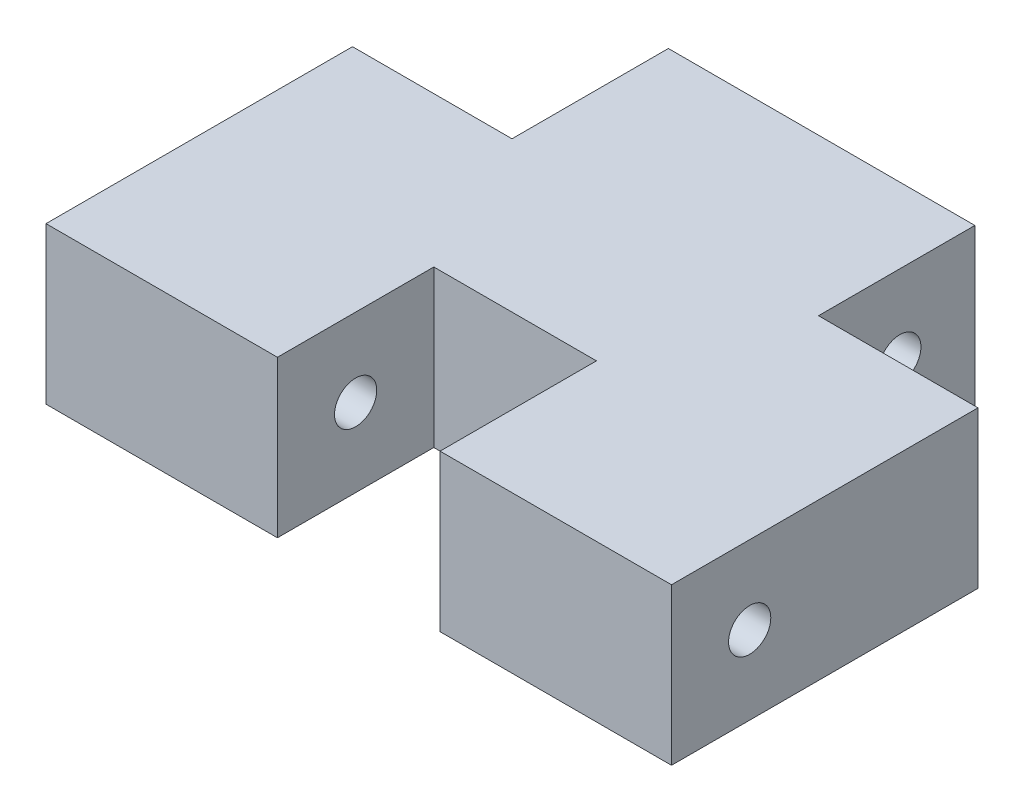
ISO-10303-21;
HEADER;
FILE_DESCRIPTION(('STEP AP214'),'2;1');
FILE_NAME('part.step','',(''),(''),'','','');
FILE_SCHEMA(('AUTOMOTIVE_DESIGN { 1 0 10303 214 1 1 1 1 }'));
ENDSEC;
DATA;
#1=APPLICATION_CONTEXT('core data for automotive mechanical design processes');
#2=APPLICATION_PROTOCOL_DEFINITION('international standard','automotive_design',2000,#1);
#3=PRODUCT_CONTEXT('',#1,'mechanical');
#4=PRODUCT('Part','Part','',(#3));
#5=PRODUCT_RELATED_PRODUCT_CATEGORY('part','',(#4));
#6=PRODUCT_DEFINITION_FORMATION('','',#4);
#7=PRODUCT_DEFINITION_CONTEXT('part definition',#1,'design');
#8=PRODUCT_DEFINITION('design','',#6,#7);
#9=PRODUCT_DEFINITION_SHAPE('','',#8);
#10=(LENGTH_UNIT() NAMED_UNIT(*) SI_UNIT(.MILLI.,.METRE.));
#11=(NAMED_UNIT(*) PLANE_ANGLE_UNIT() SI_UNIT($,.RADIAN.));
#12=(NAMED_UNIT(*) SI_UNIT($,.STERADIAN.) SOLID_ANGLE_UNIT());
#13=UNCERTAINTY_MEASURE_WITH_UNIT(LENGTH_MEASURE(1.E-05),#10,'distance_accuracy_value','');
#14=(GEOMETRIC_REPRESENTATION_CONTEXT(3) GLOBAL_UNCERTAINTY_ASSIGNED_CONTEXT((#13)) GLOBAL_UNIT_ASSIGNED_CONTEXT((#10,
#11,#12)) REPRESENTATION_CONTEXT('',''));
#15=CARTESIAN_POINT('',(0.,0.,0.));
#16=DIRECTION('',(0.,0.,1.));
#17=DIRECTION('',(1.,0.,0.));
#18=AXIS2_PLACEMENT_3D('',#15,#16,#17);
#19=CARTESIAN_POINT('',(-6.223,6.35,0.127));
#20=DIRECTION('',(1.,0.,0.));
#21=DIRECTION('',(0.,0.,-1.));
#22=AXIS2_PLACEMENT_3D('',#19,#20,#21);
#23=PLANE('',#22);
#24=CARTESIAN_POINT('',(-6.223,3.175,-3.175));
#25=DIRECTION('',(1.,0.,0.));
#26=DIRECTION('',(0.,0.,-1.));
#27=AXIS2_PLACEMENT_3D('',#24,#25,#26);
#28=CIRCLE('',#27,0.857250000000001);
#29=CARTESIAN_POINT('',(-6.223,3.175,-4.03225));
#30=VERTEX_POINT('',#29);
#31=EDGE_CURVE('E204',#30,#30,#28,.T.);
#32=ORIENTED_EDGE('',*,*,#31,.T.);
#33=EDGE_LOOP('',(#32));
#34=FACE_BOUND('',#33,.T.);
#35=DIRECTION('',(0.,0.,1.));
#36=VECTOR('',#35,1.);
#37=CARTESIAN_POINT('',(-6.223,0.,0.127));
#38=LINE('',#37,#36);
#39=CARTESIAN_POINT('',(-6.223,0.,-6.223));
#40=VERTEX_POINT('',#39);
#41=CARTESIAN_POINT('',(-6.223,0.,0.127));
#42=VERTEX_POINT('',#41);
#43=EDGE_CURVE('E156',#40,#42,#38,.T.);
#44=ORIENTED_EDGE('',*,*,#43,.T.);
#45=DIRECTION('',(0.,-1.,0.));
#46=VECTOR('',#45,1.);
#47=CARTESIAN_POINT('',(-6.223,6.35,0.127));
#48=LINE('',#47,#46);
#49=CARTESIAN_POINT('',(-6.223,6.35,0.127));
#50=VERTEX_POINT('',#49);
#51=EDGE_CURVE('E11',#50,#42,#48,.T.);
#52=ORIENTED_EDGE('',*,*,#51,.F.);
#53=DIRECTION('',(0.,0.,1.));
#54=VECTOR('',#53,1.);
#55=CARTESIAN_POINT('',(-6.223,6.35,0.127));
#56=LINE('',#55,#54);
#57=CARTESIAN_POINT('',(-6.223,6.35,-6.223));
#58=VERTEX_POINT('',#57);
#59=EDGE_CURVE('E179',#58,#50,#56,.T.);
#60=ORIENTED_EDGE('',*,*,#59,.F.);
#61=DIRECTION('',(0.,-1.,0.));
#62=VECTOR('',#61,1.);
#63=CARTESIAN_POINT('',(-6.223,6.35,-6.223));
#64=LINE('',#63,#62);
#65=EDGE_CURVE('E152',#58,#40,#64,.T.);
#66=ORIENTED_EDGE('',*,*,#65,.T.);
#67=EDGE_LOOP('',(#44,#52,#60,#66));
#68=FACE_BOUND('',#67,.T.);
#69=ADVANCED_FACE('F34',(#34,#68),#23,.F.);
#70=CARTESIAN_POINT('',(-12.7,6.35,0.127));
#71=DIRECTION('',(0.,0.,1.));
#72=DIRECTION('',(1.,0.,0.));
#73=AXIS2_PLACEMENT_3D('',#70,#71,#72);
#74=PLANE('',#73);
#75=DIRECTION('',(-1.,0.,0.));
#76=VECTOR('',#75,1.);
#77=CARTESIAN_POINT('',(-12.7,0.,0.127));
#78=LINE('',#77,#76);
#79=CARTESIAN_POINT('',(-12.7,0.,0.127));
#80=VERTEX_POINT('',#79);
#81=EDGE_CURVE('E159',#42,#80,#78,.T.);
#82=ORIENTED_EDGE('',*,*,#81,.T.);
#83=DIRECTION('',(0.,-1.,0.));
#84=VECTOR('',#83,1.);
#85=CARTESIAN_POINT('',(-12.7,6.35,0.127));
#86=LINE('',#85,#84);
#87=CARTESIAN_POINT('',(-12.7,6.35,0.127));
#88=VERTEX_POINT('',#87);
#89=EDGE_CURVE('E43',#88,#80,#86,.T.);
#90=ORIENTED_EDGE('',*,*,#89,.F.);
#91=DIRECTION('',(-1.,0.,0.));
#92=VECTOR('',#91,1.);
#93=CARTESIAN_POINT('',(-12.7,6.35,0.127));
#94=LINE('',#93,#92);
#95=EDGE_CURVE('E107',#50,#88,#94,.T.);
#96=ORIENTED_EDGE('',*,*,#95,.F.);
#97=ORIENTED_EDGE('',*,*,#51,.T.);
#98=EDGE_LOOP('',(#82,#90,#96,#97));
#99=FACE_BOUND('',#98,.T.);
#100=ADVANCED_FACE('F261',(#99),#74,.F.);
#101=CARTESIAN_POINT('',(-12.7,6.35,12.573));
#102=DIRECTION('',(1.,0.,0.));
#103=DIRECTION('',(0.,0.,-1.));
#104=AXIS2_PLACEMENT_3D('',#101,#102,#103);
#105=PLANE('',#104);
#106=CARTESIAN_POINT('',(-12.7,3.175,9.39800000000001));
#107=DIRECTION('',(1.,0.,0.));
#108=DIRECTION('',(0.,0.,-1.));
#109=AXIS2_PLACEMENT_3D('',#106,#107,#108);
#110=CIRCLE('',#109,0.85725);
#111=CARTESIAN_POINT('',(-12.7,3.175,8.54075000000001));
#112=VERTEX_POINT('',#111);
#113=EDGE_CURVE('E205',#112,#112,#110,.T.);
#114=ORIENTED_EDGE('',*,*,#113,.T.);
#115=EDGE_LOOP('',(#114));
#116=FACE_BOUND('',#115,.T.);
#117=DIRECTION('',(0.,0.,1.));
#118=VECTOR('',#117,1.);
#119=CARTESIAN_POINT('',(-12.7,0.,12.573));
#120=LINE('',#119,#118);
#121=CARTESIAN_POINT('',(-12.7,0.,12.573));
#122=VERTEX_POINT('',#121);
#123=EDGE_CURVE('E162',#80,#122,#120,.T.);
#124=ORIENTED_EDGE('',*,*,#123,.T.);
#125=DIRECTION('',(0.,-1.,0.));
#126=VECTOR('',#125,1.);
#127=CARTESIAN_POINT('',(-12.7,6.35,12.573));
#128=LINE('',#127,#126);
#129=CARTESIAN_POINT('',(-12.7,6.35,12.573));
#130=VERTEX_POINT('',#129);
#131=EDGE_CURVE('E198',#130,#122,#128,.T.);
#132=ORIENTED_EDGE('',*,*,#131,.F.);
#133=DIRECTION('',(0.,0.,1.));
#134=VECTOR('',#133,1.);
#135=CARTESIAN_POINT('',(-12.7,6.35,12.573));
#136=LINE('',#135,#134);
#137=EDGE_CURVE('E222',#88,#130,#136,.T.);
#138=ORIENTED_EDGE('',*,*,#137,.F.);
#139=ORIENTED_EDGE('',*,*,#89,.T.);
#140=EDGE_LOOP('',(#124,#132,#138,#139));
#141=FACE_BOUND('',#140,.T.);
#142=ADVANCED_FACE('F266',(#116,#141),#105,.F.);
#143=CARTESIAN_POINT('',(-3.302,6.35,12.573));
#144=DIRECTION('',(0.,0.,-1.));
#145=DIRECTION('',(-1.,0.,0.));
#146=AXIS2_PLACEMENT_3D('',#143,#144,#145);
#147=PLANE('',#146);
#148=DIRECTION('',(1.,0.,0.));
#149=VECTOR('',#148,1.);
#150=CARTESIAN_POINT('',(-3.302,0.,12.573));
#151=LINE('',#150,#149);
#152=CARTESIAN_POINT('',(-3.302,0.,12.573));
#153=VERTEX_POINT('',#152);
#154=EDGE_CURVE('E164',#122,#153,#151,.T.);
#155=ORIENTED_EDGE('',*,*,#154,.T.);
#156=DIRECTION('',(0.,-1.,0.));
#157=VECTOR('',#156,1.);
#158=CARTESIAN_POINT('',(-3.302,6.35,12.573));
#159=LINE('',#158,#157);
#160=CARTESIAN_POINT('',(-3.302,6.35,12.573));
#161=VERTEX_POINT('',#160);
#162=EDGE_CURVE('E195',#161,#153,#159,.T.);
#163=ORIENTED_EDGE('',*,*,#162,.F.);
#164=DIRECTION('',(1.,0.,0.));
#165=VECTOR('',#164,1.);
#166=CARTESIAN_POINT('',(-3.302,6.35,12.573));
#167=LINE('',#166,#165);
#168=EDGE_CURVE('E224',#130,#161,#167,.T.);
#169=ORIENTED_EDGE('',*,*,#168,.F.);
#170=ORIENTED_EDGE('',*,*,#131,.T.);
#171=EDGE_LOOP('',(#155,#163,#169,#170));
#172=FACE_BOUND('',#171,.T.);
#173=ADVANCED_FACE('F292',(#172),#147,.F.);
#174=CARTESIAN_POINT('',(-3.302,6.35,6.223));
#175=DIRECTION('',(-1.,0.,0.));
#176=DIRECTION('',(0.,0.,1.));
#177=AXIS2_PLACEMENT_3D('',#174,#175,#176);
#178=PLANE('',#177);
#179=CARTESIAN_POINT('',(-3.302,3.175,9.398));
#180=DIRECTION('',(-1.,0.,0.));
#181=DIRECTION('',(0.,0.,1.));
#182=AXIS2_PLACEMENT_3D('',#179,#180,#181);
#183=CIRCLE('',#182,0.85725);
#184=CARTESIAN_POINT('',(-3.302,3.175,10.25525));
#185=VERTEX_POINT('',#184);
#186=EDGE_CURVE('E160',#185,#185,#183,.T.);
#187=ORIENTED_EDGE('',*,*,#186,.T.);
#188=EDGE_LOOP('',(#187));
#189=FACE_BOUND('',#188,.T.);
#190=DIRECTION('',(0.,0.,-1.));
#191=VECTOR('',#190,1.);
#192=CARTESIAN_POINT('',(-3.302,0.,6.223));
#193=LINE('',#192,#191);
#194=CARTESIAN_POINT('',(-3.302,0.,6.223));
#195=VERTEX_POINT('',#194);
#196=EDGE_CURVE('E166',#153,#195,#193,.T.);
#197=ORIENTED_EDGE('',*,*,#196,.T.);
#198=DIRECTION('',(0.,-1.,0.));
#199=VECTOR('',#198,1.);
#200=CARTESIAN_POINT('',(-3.302,6.35,6.223));
#201=LINE('',#200,#199);
#202=CARTESIAN_POINT('',(-3.302,6.35,6.223));
#203=VERTEX_POINT('',#202);
#204=EDGE_CURVE('E192',#203,#195,#201,.T.);
#205=ORIENTED_EDGE('',*,*,#204,.F.);
#206=DIRECTION('',(0.,0.,-1.));
#207=VECTOR('',#206,1.);
#208=CARTESIAN_POINT('',(-3.302,6.35,6.223));
#209=LINE('',#208,#207);
#210=EDGE_CURVE('E226',#161,#203,#209,.T.);
#211=ORIENTED_EDGE('',*,*,#210,.F.);
#212=ORIENTED_EDGE('',*,*,#162,.T.);
#213=EDGE_LOOP('',(#197,#205,#211,#212));
#214=FACE_BOUND('',#213,.T.);
#215=ADVANCED_FACE('F288',(#189,#214),#178,.F.);
#216=CARTESIAN_POINT('',(3.302,6.35,6.223));
#217=DIRECTION('',(0.,0.,-1.));
#218=DIRECTION('',(-1.,0.,0.));
#219=AXIS2_PLACEMENT_3D('',#216,#217,#218);
#220=PLANE('',#219);
#221=DIRECTION('',(1.,0.,0.));
#222=VECTOR('',#221,1.);
#223=CARTESIAN_POINT('',(3.302,0.,6.223));
#224=LINE('',#223,#222);
#225=CARTESIAN_POINT('',(3.302,0.,6.223));
#226=VERTEX_POINT('',#225);
#227=EDGE_CURVE('E168',#195,#226,#224,.T.);
#228=ORIENTED_EDGE('',*,*,#227,.T.);
#229=DIRECTION('',(0.,-1.,0.));
#230=VECTOR('',#229,1.);
#231=CARTESIAN_POINT('',(3.302,6.35,6.223));
#232=LINE('',#231,#230);
#233=CARTESIAN_POINT('',(3.302,6.35,6.223));
#234=VERTEX_POINT('',#233);
#235=EDGE_CURVE('E189',#234,#226,#232,.T.);
#236=ORIENTED_EDGE('',*,*,#235,.F.);
#237=DIRECTION('',(1.,0.,0.));
#238=VECTOR('',#237,1.);
#239=CARTESIAN_POINT('',(3.302,6.35,6.223));
#240=LINE('',#239,#238);
#241=EDGE_CURVE('E228',#203,#234,#240,.T.);
#242=ORIENTED_EDGE('',*,*,#241,.F.);
#243=ORIENTED_EDGE('',*,*,#204,.T.);
#244=EDGE_LOOP('',(#228,#236,#242,#243));
#245=FACE_BOUND('',#244,.T.);
#246=ADVANCED_FACE('F291',(#245),#220,.F.);
#247=CARTESIAN_POINT('',(3.302,6.35,12.573));
#248=DIRECTION('',(1.,0.,0.));
#249=DIRECTION('',(0.,0.,-1.));
#250=AXIS2_PLACEMENT_3D('',#247,#248,#249);
#251=PLANE('',#250);
#252=CARTESIAN_POINT('',(3.302,3.175,9.398));
#253=DIRECTION('',(1.,0.,0.));
#254=DIRECTION('',(0.,0.,-1.));
#255=AXIS2_PLACEMENT_3D('',#252,#253,#254);
#256=CIRCLE('',#255,0.85725);
#257=CARTESIAN_POINT('',(3.302,3.175,8.54075));
#258=VERTEX_POINT('',#257);
#259=EDGE_CURVE('E215',#258,#258,#256,.T.);
#260=ORIENTED_EDGE('',*,*,#259,.T.);
#261=EDGE_LOOP('',(#260));
#262=FACE_BOUND('',#261,.T.);
#263=DIRECTION('',(0.,0.,1.));
#264=VECTOR('',#263,1.);
#265=CARTESIAN_POINT('',(3.302,0.,12.573));
#266=LINE('',#265,#264);
#267=CARTESIAN_POINT('',(3.302,0.,12.573));
#268=VERTEX_POINT('',#267);
#269=EDGE_CURVE('E170',#226,#268,#266,.T.);
#270=ORIENTED_EDGE('',*,*,#269,.T.);
#271=DIRECTION('',(0.,-1.,0.));
#272=VECTOR('',#271,1.);
#273=CARTESIAN_POINT('',(3.302,6.35,12.573));
#274=LINE('',#273,#272);
#275=CARTESIAN_POINT('',(3.302,6.35,12.573));
#276=VERTEX_POINT('',#275);
#277=EDGE_CURVE('E186',#276,#268,#274,.T.);
#278=ORIENTED_EDGE('',*,*,#277,.F.);
#279=DIRECTION('',(0.,0.,1.));
#280=VECTOR('',#279,1.);
#281=CARTESIAN_POINT('',(3.302,6.35,12.573));
#282=LINE('',#281,#280);
#283=EDGE_CURVE('E230',#234,#276,#282,.T.);
#284=ORIENTED_EDGE('',*,*,#283,.F.);
#285=ORIENTED_EDGE('',*,*,#235,.T.);
#286=EDGE_LOOP('',(#270,#278,#284,#285));
#287=FACE_BOUND('',#286,.T.);
#288=ADVANCED_FACE('F305',(#262,#287),#251,.F.);
#289=CARTESIAN_POINT('',(12.7,6.35,12.573));
#290=DIRECTION('',(0.,0.,-1.));
#291=DIRECTION('',(-1.,0.,0.));
#292=AXIS2_PLACEMENT_3D('',#289,#290,#291);
#293=PLANE('',#292);
#294=DIRECTION('',(1.,0.,0.));
#295=VECTOR('',#294,1.);
#296=CARTESIAN_POINT('',(12.7,0.,12.573));
#297=LINE('',#296,#295);
#298=CARTESIAN_POINT('',(12.7,0.,12.573));
#299=VERTEX_POINT('',#298);
#300=EDGE_CURVE('E172',#268,#299,#297,.T.);
#301=ORIENTED_EDGE('',*,*,#300,.T.);
#302=DIRECTION('',(0.,-1.,0.));
#303=VECTOR('',#302,1.);
#304=CARTESIAN_POINT('',(12.7,6.35,12.573));
#305=LINE('',#304,#303);
#306=CARTESIAN_POINT('',(12.7,6.35,12.573));
#307=VERTEX_POINT('',#306);
#308=EDGE_CURVE('E183',#307,#299,#305,.T.);
#309=ORIENTED_EDGE('',*,*,#308,.F.);
#310=DIRECTION('',(1.,0.,0.));
#311=VECTOR('',#310,1.);
#312=CARTESIAN_POINT('',(12.7,6.35,12.573));
#313=LINE('',#312,#311);
#314=EDGE_CURVE('E232',#276,#307,#313,.T.);
#315=ORIENTED_EDGE('',*,*,#314,.F.);
#316=ORIENTED_EDGE('',*,*,#277,.T.);
#317=EDGE_LOOP('',(#301,#309,#315,#316));
#318=FACE_BOUND('',#317,.T.);
#319=ADVANCED_FACE('F238',(#318),#293,.F.);
#320=CARTESIAN_POINT('',(12.7,6.35,0.127));
#321=DIRECTION('',(-1.,0.,0.));
#322=DIRECTION('',(0.,0.,1.));
#323=AXIS2_PLACEMENT_3D('',#320,#321,#322);
#324=PLANE('',#323);
#325=CARTESIAN_POINT('',(12.7,3.175,9.398));
#326=DIRECTION('',(-1.,0.,0.));
#327=DIRECTION('',(0.,0.,1.));
#328=AXIS2_PLACEMENT_3D('',#325,#326,#327);
#329=CIRCLE('',#328,0.85725);
#330=CARTESIAN_POINT('',(12.7,3.175,10.25525));
#331=VERTEX_POINT('',#330);
#332=EDGE_CURVE('E37',#331,#331,#329,.T.);
#333=ORIENTED_EDGE('',*,*,#332,.T.);
#334=EDGE_LOOP('',(#333));
#335=FACE_BOUND('',#334,.T.);
#336=DIRECTION('',(0.,0.,-1.));
#337=VECTOR('',#336,1.);
#338=CARTESIAN_POINT('',(12.7,0.,0.127));
#339=LINE('',#338,#337);
#340=CARTESIAN_POINT('',(12.7,0.,0.127));
#341=VERTEX_POINT('',#340);
#342=EDGE_CURVE('E174',#299,#341,#339,.T.);
#343=ORIENTED_EDGE('',*,*,#342,.T.);
#344=DIRECTION('',(0.,-1.,0.));
#345=VECTOR('',#344,1.);
#346=CARTESIAN_POINT('',(12.7,6.35,0.127));
#347=LINE('',#346,#345);
#348=CARTESIAN_POINT('',(12.7,6.35,0.127));
#349=VERTEX_POINT('',#348);
#350=EDGE_CURVE('E147',#349,#341,#347,.T.);
#351=ORIENTED_EDGE('',*,*,#350,.F.);
#352=DIRECTION('',(0.,0.,-1.));
#353=VECTOR('',#352,1.);
#354=CARTESIAN_POINT('',(12.7,6.35,0.127));
#355=LINE('',#354,#353);
#356=EDGE_CURVE('E138',#307,#349,#355,.T.);
#357=ORIENTED_EDGE('',*,*,#356,.F.);
#358=ORIENTED_EDGE('',*,*,#308,.T.);
#359=EDGE_LOOP('',(#343,#351,#357,#358));
#360=FACE_BOUND('',#359,.T.);
#361=ADVANCED_FACE('F242',(#335,#360),#324,.F.);
#362=CARTESIAN_POINT('',(6.223,6.35,0.127));
#363=DIRECTION('',(0.,0.,1.));
#364=DIRECTION('',(1.,0.,0.));
#365=AXIS2_PLACEMENT_3D('',#362,#363,#364);
#366=PLANE('',#365);
#367=DIRECTION('',(-1.,0.,0.));
#368=VECTOR('',#367,1.);
#369=CARTESIAN_POINT('',(6.223,0.,0.127));
#370=LINE('',#369,#368);
#371=CARTESIAN_POINT('',(6.223,0.,0.127));
#372=VERTEX_POINT('',#371);
#373=EDGE_CURVE('E146',#341,#372,#370,.T.);
#374=ORIENTED_EDGE('',*,*,#373,.T.);
#375=DIRECTION('',(0.,-1.,0.));
#376=VECTOR('',#375,1.);
#377=CARTESIAN_POINT('',(6.223,6.35,0.127));
#378=LINE('',#377,#376);
#379=CARTESIAN_POINT('',(6.223,6.35,0.127));
#380=VERTEX_POINT('',#379);
#381=EDGE_CURVE('E143',#380,#372,#378,.T.);
#382=ORIENTED_EDGE('',*,*,#381,.F.);
#383=DIRECTION('',(-1.,0.,0.));
#384=VECTOR('',#383,1.);
#385=CARTESIAN_POINT('',(6.223,6.35,0.127));
#386=LINE('',#385,#384);
#387=EDGE_CURVE('E132',#349,#380,#386,.T.);
#388=ORIENTED_EDGE('',*,*,#387,.F.);
#389=ORIENTED_EDGE('',*,*,#350,.T.);
#390=EDGE_LOOP('',(#374,#382,#388,#389));
#391=FACE_BOUND('',#390,.T.);
#392=ADVANCED_FACE('F144',(#391),#366,.F.);
#393=CARTESIAN_POINT('',(6.223,6.35,-6.223));
#394=DIRECTION('',(-1.,0.,0.));
#395=DIRECTION('',(0.,0.,1.));
#396=AXIS2_PLACEMENT_3D('',#393,#394,#395);
#397=PLANE('',#396);
#398=CARTESIAN_POINT('',(6.223,3.175,-3.175));
#399=DIRECTION('',(-1.,0.,0.));
#400=DIRECTION('',(0.,0.,1.));
#401=AXIS2_PLACEMENT_3D('',#398,#399,#400);
#402=CIRCLE('',#401,0.857250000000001);
#403=CARTESIAN_POINT('',(6.223,3.175,-2.31775));
#404=VERTEX_POINT('',#403);
#405=EDGE_CURVE('E202',#404,#404,#402,.T.);
#406=ORIENTED_EDGE('',*,*,#405,.T.);
#407=EDGE_LOOP('',(#406));
#408=FACE_BOUND('',#407,.T.);
#409=DIRECTION('',(0.,0.,-1.));
#410=VECTOR('',#409,1.);
#411=CARTESIAN_POINT('',(6.223,0.,-6.223));
#412=LINE('',#411,#410);
#413=CARTESIAN_POINT('',(6.223,0.,-6.223));
#414=VERTEX_POINT('',#413);
#415=EDGE_CURVE('E93',#372,#414,#412,.T.);
#416=ORIENTED_EDGE('',*,*,#415,.T.);
#417=DIRECTION('',(0.,-1.,0.));
#418=VECTOR('',#417,1.);
#419=CARTESIAN_POINT('',(6.223,6.35,-6.223));
#420=LINE('',#419,#418);
#421=CARTESIAN_POINT('',(6.223,6.35,-6.223));
#422=VERTEX_POINT('',#421);
#423=EDGE_CURVE('E148',#422,#414,#420,.T.);
#424=ORIENTED_EDGE('',*,*,#423,.F.);
#425=DIRECTION('',(0.,0.,-1.));
#426=VECTOR('',#425,1.);
#427=CARTESIAN_POINT('',(6.223,6.35,-6.223));
#428=LINE('',#427,#426);
#429=EDGE_CURVE('E136',#380,#422,#428,.T.);
#430=ORIENTED_EDGE('',*,*,#429,.F.);
#431=ORIENTED_EDGE('',*,*,#381,.T.);
#432=EDGE_LOOP('',(#416,#424,#430,#431));
#433=FACE_BOUND('',#432,.T.);
#434=ADVANCED_FACE('F150',(#408,#433),#397,.F.);
#435=CARTESIAN_POINT('',(-6.223,6.35,-6.223));
#436=DIRECTION('',(0.,0.,1.));
#437=DIRECTION('',(1.,0.,0.));
#438=AXIS2_PLACEMENT_3D('',#435,#436,#437);
#439=PLANE('',#438);
#440=DIRECTION('',(-1.,0.,0.));
#441=VECTOR('',#440,1.);
#442=CARTESIAN_POINT('',(-6.223,0.,-6.223));
#443=LINE('',#442,#441);
#444=EDGE_CURVE('E99',#414,#40,#443,.T.);
#445=ORIENTED_EDGE('',*,*,#444,.T.);
#446=ORIENTED_EDGE('',*,*,#65,.F.);
#447=DIRECTION('',(-1.,0.,0.));
#448=VECTOR('',#447,1.);
#449=CARTESIAN_POINT('',(-6.223,6.35,-6.223));
#450=LINE('',#449,#448);
#451=EDGE_CURVE('E52',#422,#58,#450,.T.);
#452=ORIENTED_EDGE('',*,*,#451,.F.);
#453=ORIENTED_EDGE('',*,*,#423,.T.);
#454=EDGE_LOOP('',(#445,#446,#452,#453));
#455=FACE_BOUND('',#454,.T.);
#456=ADVANCED_FACE('F250',(#455),#439,.F.);
#457=CARTESIAN_POINT('',(0.,6.35,0.));
#458=DIRECTION('',(0.,-1.,0.));
#459=DIRECTION('',(0.,0.,-1.));
#460=AXIS2_PLACEMENT_3D('',#457,#458,#459);
#461=PLANE('',#460);
#462=ORIENTED_EDGE('',*,*,#59,.T.);
#463=ORIENTED_EDGE('',*,*,#95,.T.);
#464=ORIENTED_EDGE('',*,*,#137,.T.);
#465=ORIENTED_EDGE('',*,*,#168,.T.);
#466=ORIENTED_EDGE('',*,*,#210,.T.);
#467=ORIENTED_EDGE('',*,*,#241,.T.);
#468=ORIENTED_EDGE('',*,*,#283,.T.);
#469=ORIENTED_EDGE('',*,*,#314,.T.);
#470=ORIENTED_EDGE('',*,*,#356,.T.);
#471=ORIENTED_EDGE('',*,*,#387,.T.);
#472=ORIENTED_EDGE('',*,*,#429,.T.);
#473=ORIENTED_EDGE('',*,*,#451,.T.);
#474=EDGE_LOOP('',(#462,#463,#464,#465,#466,#467,#468,#469,#470,#471,#472,#473));
#475=FACE_BOUND('',#474,.T.);
#476=ADVANCED_FACE('F134',(#475),#461,.F.);
#477=CARTESIAN_POINT('',(0.,0.,0.));
#478=DIRECTION('',(0.,-1.,0.));
#479=DIRECTION('',(0.,0.,-1.));
#480=AXIS2_PLACEMENT_3D('',#477,#478,#479);
#481=PLANE('',#480);
#482=ORIENTED_EDGE('',*,*,#43,.F.);
#483=ORIENTED_EDGE('',*,*,#444,.F.);
#484=ORIENTED_EDGE('',*,*,#415,.F.);
#485=ORIENTED_EDGE('',*,*,#373,.F.);
#486=ORIENTED_EDGE('',*,*,#342,.F.);
#487=ORIENTED_EDGE('',*,*,#300,.F.);
#488=ORIENTED_EDGE('',*,*,#269,.F.);
#489=ORIENTED_EDGE('',*,*,#227,.F.);
#490=ORIENTED_EDGE('',*,*,#196,.F.);
#491=ORIENTED_EDGE('',*,*,#154,.F.);
#492=ORIENTED_EDGE('',*,*,#123,.F.);
#493=ORIENTED_EDGE('',*,*,#81,.F.);
#494=EDGE_LOOP('',(#482,#483,#484,#485,#486,#487,#488,#489,#490,#491,#492,#493));
#495=FACE_BOUND('',#494,.T.);
#496=ADVANCED_FACE('F245',(#495),#481,.T.);
#497=CARTESIAN_POINT('',(-12.7,3.175,-3.17499999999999));
#498=DIRECTION('',(1.,0.,0.));
#499=DIRECTION('',(0.,0.,-1.));
#500=AXIS2_PLACEMENT_3D('',#497,#498,#499);
#501=CYLINDRICAL_SURFACE('',#500,0.857250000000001);
#502=ORIENTED_EDGE('',*,*,#405,.F.);
#503=EDGE_LOOP('',(#502));
#504=FACE_BOUND('',#503,.T.);
#505=ORIENTED_EDGE('',*,*,#31,.F.);
#506=EDGE_LOOP('',(#505));
#507=FACE_BOUND('',#506,.T.);
#508=ADVANCED_FACE('F269',(#504,#507),#501,.F.);
#509=CARTESIAN_POINT('',(-12.7,3.175,9.39800000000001));
#510=DIRECTION('',(1.,0.,0.));
#511=DIRECTION('',(0.,0.,-1.));
#512=AXIS2_PLACEMENT_3D('',#509,#510,#511);
#513=CYLINDRICAL_SURFACE('',#512,0.85725);
#514=ORIENTED_EDGE('',*,*,#332,.F.);
#515=EDGE_LOOP('',(#514));
#516=FACE_BOUND('',#515,.T.);
#517=ORIENTED_EDGE('',*,*,#259,.F.);
#518=EDGE_LOOP('',(#517));
#519=FACE_BOUND('',#518,.T.);
#520=ADVANCED_FACE('F271',(#516,#519),#513,.F.);
#521=ORIENTED_EDGE('',*,*,#113,.F.);
#522=EDGE_LOOP('',(#521));
#523=FACE_BOUND('',#522,.T.);
#524=ORIENTED_EDGE('',*,*,#186,.F.);
#525=EDGE_LOOP('',(#524));
#526=FACE_BOUND('',#525,.T.);
#527=ADVANCED_FACE('F278',(#523,#526),#513,.F.);
#528=CLOSED_SHELL('',(#69,#100,#142,#173,#215,#246,#288,#319,#361,#392,#434,#456,#476,#496,#508,
#520,#527));
#529=MANIFOLD_SOLID_BREP('B2',#528);
#530=ADVANCED_BREP_SHAPE_REPRESENTATION('',(#18,#529),#14);
#531=SHAPE_DEFINITION_REPRESENTATION(#9,#530);
ENDSEC;
END-ISO-10303-21;
